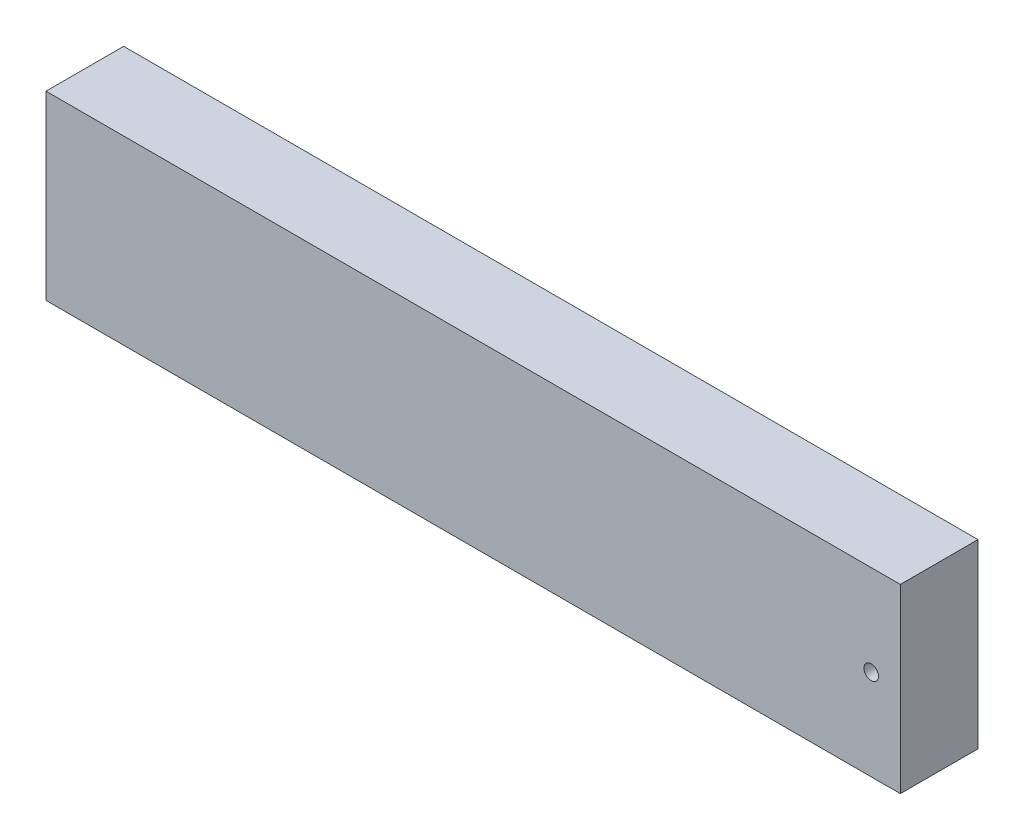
from build123d import *

# Parameters (mm, degrees)
SKETCH1_W                       = 419.1
SKETCH1_H                       = 88.9
BOSS_EXTRUDE1_DEPTH             = 38.1
F_9_32_0_28125_DIAMETER_HOLE1_D = 7.14375


with BuildPart() as part:
    # Sketch1 → Boss-Extrude1 (new body)
    with BuildSketch(Plane.XY):
        with Locations((209.55, 44.45)):
            Rectangle(SKETCH1_W, SKETCH1_H)
    extrude(amount=BOSS_EXTRUDE1_DEPTH)

    # 9_32 _0.28125_ Diameter Hole1 (through all)
    with Locations(Plane.XY.offset(38.1)):
        with Locations((404.8125, 44.45)):
            Hole(F_9_32_0_28125_DIAMETER_HOLE1_D / 2)


solid = part.part
